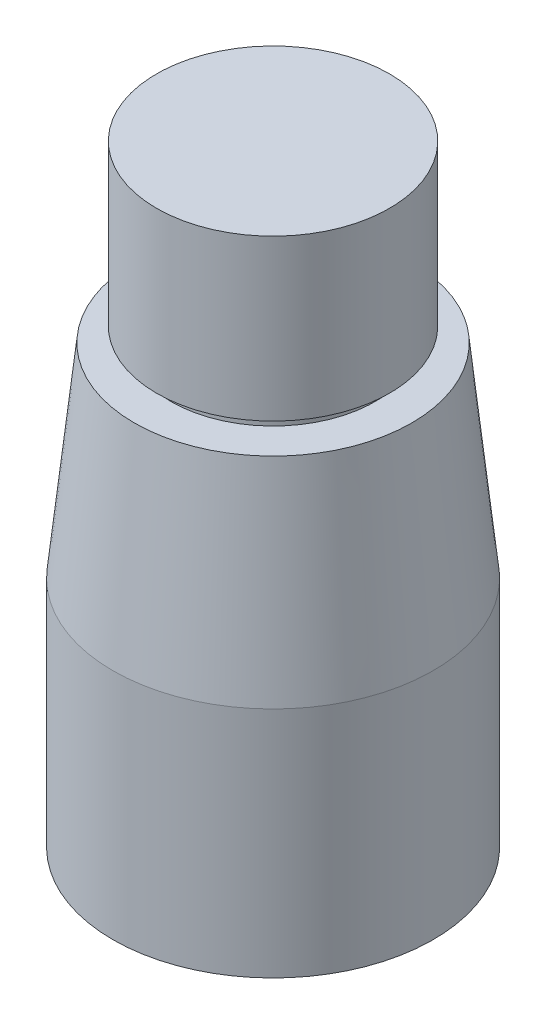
ISO-10303-21;
HEADER;
FILE_DESCRIPTION(('STEP AP214'),'2;1');
FILE_NAME('part.step','',(''),(''),'','','');
FILE_SCHEMA(('AUTOMOTIVE_DESIGN { 1 0 10303 214 1 1 1 1 }'));
ENDSEC;
DATA;
#1=APPLICATION_CONTEXT('core data for automotive mechanical design processes');
#2=APPLICATION_PROTOCOL_DEFINITION('international standard','automotive_design',2000,#1);
#3=PRODUCT_CONTEXT('',#1,'mechanical');
#4=PRODUCT('Part','Part','',(#3));
#5=PRODUCT_RELATED_PRODUCT_CATEGORY('part','',(#4));
#6=PRODUCT_DEFINITION_FORMATION('','',#4);
#7=PRODUCT_DEFINITION_CONTEXT('part definition',#1,'design');
#8=PRODUCT_DEFINITION('design','',#6,#7);
#9=PRODUCT_DEFINITION_SHAPE('','',#8);
#10=(LENGTH_UNIT() NAMED_UNIT(*) SI_UNIT(.MILLI.,.METRE.));
#11=(NAMED_UNIT(*) PLANE_ANGLE_UNIT() SI_UNIT($,.RADIAN.));
#12=(NAMED_UNIT(*) SI_UNIT($,.STERADIAN.) SOLID_ANGLE_UNIT());
#13=UNCERTAINTY_MEASURE_WITH_UNIT(LENGTH_MEASURE(1.E-05),#10,'distance_accuracy_value','');
#14=(GEOMETRIC_REPRESENTATION_CONTEXT(3) GLOBAL_UNCERTAINTY_ASSIGNED_CONTEXT((#13)) GLOBAL_UNIT_ASSIGNED_CONTEXT((#10,
#11,#12)) REPRESENTATION_CONTEXT('',''));
#15=CARTESIAN_POINT('',(0.,0.,0.));
#16=DIRECTION('',(0.,0.,1.));
#17=DIRECTION('',(1.,0.,0.));
#18=AXIS2_PLACEMENT_3D('',#15,#16,#17);
#19=CARTESIAN_POINT('',(0.,0.,0.));
#20=DIRECTION('',(0.,-1.,0.));
#21=DIRECTION('',(0.,0.,-1.));
#22=AXIS2_PLACEMENT_3D('',#19,#20,#21);
#23=PLANE('',#22);
#24=CARTESIAN_POINT('',(0.,0.,0.));
#25=DIRECTION('',(0.,1.,0.));
#26=DIRECTION('',(0.,0.,1.));
#27=AXIS2_PLACEMENT_3D('',#24,#25,#26);
#28=CIRCLE('',#27,11.);
#29=CARTESIAN_POINT('',(0.,0.,11.));
#30=VERTEX_POINT('',#29);
#31=EDGE_CURVE('E10',#30,#30,#28,.T.);
#32=ORIENTED_EDGE('',*,*,#31,.F.);
#33=EDGE_LOOP('',(#32));
#34=FACE_BOUND('',#33,.T.);
#35=ADVANCED_FACE('F31',(#34),#23,.T.);
#36=CARTESIAN_POINT('',(0.,85.1026449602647,0.));
#37=DIRECTION('',(0.,1.,0.));
#38=DIRECTION('',(0.,0.,1.));
#39=AXIS2_PLACEMENT_3D('',#36,#37,#38);
#40=CYLINDRICAL_SURFACE('',#39,11.);
#41=ORIENTED_EDGE('',*,*,#31,.T.);
#42=EDGE_LOOP('',(#41));
#43=FACE_BOUND('',#42,.T.);
#44=CARTESIAN_POINT('',(0.,16.,0.));
#45=DIRECTION('',(0.,1.,0.));
#46=DIRECTION('',(0.,0.,1.));
#47=AXIS2_PLACEMENT_3D('',#44,#45,#46);
#48=CIRCLE('',#47,11.);
#49=CARTESIAN_POINT('',(0.,16.,11.));
#50=VERTEX_POINT('',#49);
#51=EDGE_CURVE('E37',#50,#50,#48,.T.);
#52=ORIENTED_EDGE('',*,*,#51,.F.);
#53=EDGE_LOOP('',(#52));
#54=FACE_BOUND('',#53,.T.);
#55=ADVANCED_FACE('F76',(#43,#54),#40,.T.);
#56=CARTESIAN_POINT('',(0.,30.,0.));
#57=DIRECTION('',(0.,-1.,0.));
#58=DIRECTION('',(0.,0.,-1.));
#59=AXIS2_PLACEMENT_3D('',#56,#57,#58);
#60=CONICAL_SURFACE('',#59,9.52854070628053,0.10471975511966);
#61=ORIENTED_EDGE('',*,*,#51,.T.);
#62=EDGE_LOOP('',(#61));
#63=FACE_BOUND('',#62,.T.);
#64=CARTESIAN_POINT('',(0.,30.,0.));
#65=DIRECTION('',(0.,1.,0.));
#66=DIRECTION('',(0.,0.,1.));
#67=AXIS2_PLACEMENT_3D('',#64,#65,#66);
#68=CIRCLE('',#67,9.52854070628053);
#69=CARTESIAN_POINT('',(0.,30.,9.52854070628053));
#70=VERTEX_POINT('',#69);
#71=EDGE_CURVE('E41',#70,#70,#68,.T.);
#72=ORIENTED_EDGE('',*,*,#71,.F.);
#73=EDGE_LOOP('',(#72));
#74=FACE_BOUND('',#73,.T.);
#75=ADVANCED_FACE('F81',(#63,#74),#60,.T.);
#76=CARTESIAN_POINT('',(-9.52854070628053,30.,0.));
#77=DIRECTION('',(0.,1.,0.));
#78=DIRECTION('',(0.,0.,1.));
#79=AXIS2_PLACEMENT_3D('',#76,#77,#78);
#80=PLANE('',#79);
#81=ORIENTED_EDGE('',*,*,#71,.T.);
#82=EDGE_LOOP('',(#81));
#83=FACE_BOUND('',#82,.T.);
#84=CARTESIAN_POINT('',(0.,30.,0.));
#85=DIRECTION('',(0.,1.,0.));
#86=DIRECTION('',(0.,0.,1.));
#87=AXIS2_PLACEMENT_3D('',#84,#85,#86);
#88=CIRCLE('',#87,7.);
#89=CARTESIAN_POINT('',(0.,30.,7.));
#90=VERTEX_POINT('',#89);
#91=EDGE_CURVE('E45',#90,#90,#88,.T.);
#92=ORIENTED_EDGE('',*,*,#91,.F.);
#93=EDGE_LOOP('',(#92));
#94=FACE_BOUND('',#93,.T.);
#95=ADVANCED_FACE('F85',(#83,#94),#80,.T.);
#96=CARTESIAN_POINT('',(0.,85.1026449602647,0.));
#97=DIRECTION('',(0.,1.,0.));
#98=DIRECTION('',(0.,0.,1.));
#99=AXIS2_PLACEMENT_3D('',#96,#97,#98);
#100=CYLINDRICAL_SURFACE('',#99,7.);
#101=ORIENTED_EDGE('',*,*,#91,.T.);
#102=EDGE_LOOP('',(#101));
#103=FACE_BOUND('',#102,.T.);
#104=CARTESIAN_POINT('',(0.,31.,0.));
#105=DIRECTION('',(0.,1.,0.));
#106=DIRECTION('',(0.,0.,1.));
#107=AXIS2_PLACEMENT_3D('',#104,#105,#106);
#108=CIRCLE('',#107,7.);
#109=CARTESIAN_POINT('',(0.,31.,7.));
#110=VERTEX_POINT('',#109);
#111=EDGE_CURVE('E50',#110,#110,#108,.T.);
#112=ORIENTED_EDGE('',*,*,#111,.F.);
#113=EDGE_LOOP('',(#112));
#114=FACE_BOUND('',#113,.T.);
#115=ADVANCED_FACE('F72',(#103,#114),#100,.T.);
#116=CARTESIAN_POINT('',(-7.,31.,0.));
#117=DIRECTION('',(0.,-1.,0.));
#118=DIRECTION('',(0.,0.,-1.));
#119=AXIS2_PLACEMENT_3D('',#116,#117,#118);
#120=PLANE('',#119);
#121=ORIENTED_EDGE('',*,*,#111,.T.);
#122=EDGE_LOOP('',(#121));
#123=FACE_BOUND('',#122,.T.);
#124=CARTESIAN_POINT('',(0.,31.,0.));
#125=DIRECTION('',(0.,1.,0.));
#126=DIRECTION('',(0.,0.,1.));
#127=AXIS2_PLACEMENT_3D('',#124,#125,#126);
#128=CIRCLE('',#127,8.);
#129=CARTESIAN_POINT('',(0.,31.,8.));
#130=VERTEX_POINT('',#129);
#131=EDGE_CURVE('E53',#130,#130,#128,.T.);
#132=ORIENTED_EDGE('',*,*,#131,.F.);
#133=EDGE_LOOP('',(#132));
#134=FACE_BOUND('',#133,.T.);
#135=ADVANCED_FACE('F64',(#123,#134),#120,.T.);
#136=CARTESIAN_POINT('',(0.,85.1026449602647,0.));
#137=DIRECTION('',(0.,1.,0.));
#138=DIRECTION('',(0.,0.,1.));
#139=AXIS2_PLACEMENT_3D('',#136,#137,#138);
#140=CYLINDRICAL_SURFACE('',#139,8.);
#141=ORIENTED_EDGE('',*,*,#131,.T.);
#142=EDGE_LOOP('',(#141));
#143=FACE_BOUND('',#142,.T.);
#144=CARTESIAN_POINT('',(0.,42.,0.));
#145=DIRECTION('',(0.,1.,0.));
#146=DIRECTION('',(0.,0.,1.));
#147=AXIS2_PLACEMENT_3D('',#144,#145,#146);
#148=CIRCLE('',#147,8.);
#149=CARTESIAN_POINT('',(0.,42.,8.));
#150=VERTEX_POINT('',#149);
#151=EDGE_CURVE('E56',#150,#150,#148,.T.);
#152=ORIENTED_EDGE('',*,*,#151,.F.);
#153=EDGE_LOOP('',(#152));
#154=FACE_BOUND('',#153,.T.);
#155=ADVANCED_FACE('F62',(#143,#154),#140,.T.);
#156=CARTESIAN_POINT('',(-8.,42.,0.));
#157=DIRECTION('',(0.,1.,0.));
#158=DIRECTION('',(0.,0.,1.));
#159=AXIS2_PLACEMENT_3D('',#156,#157,#158);
#160=PLANE('',#159);
#161=ORIENTED_EDGE('',*,*,#151,.T.);
#162=EDGE_LOOP('',(#161));
#163=FACE_BOUND('',#162,.T.);
#164=ADVANCED_FACE('F60',(#163),#160,.T.);
#165=CLOSED_SHELL('',(#35,#55,#75,#95,#115,#135,#155,#164));
#166=MANIFOLD_SOLID_BREP('B2',#165);
#167=ADVANCED_BREP_SHAPE_REPRESENTATION('',(#18,#166),#14);
#168=SHAPE_DEFINITION_REPRESENTATION(#9,#167);
ENDSEC;
END-ISO-10303-21;
